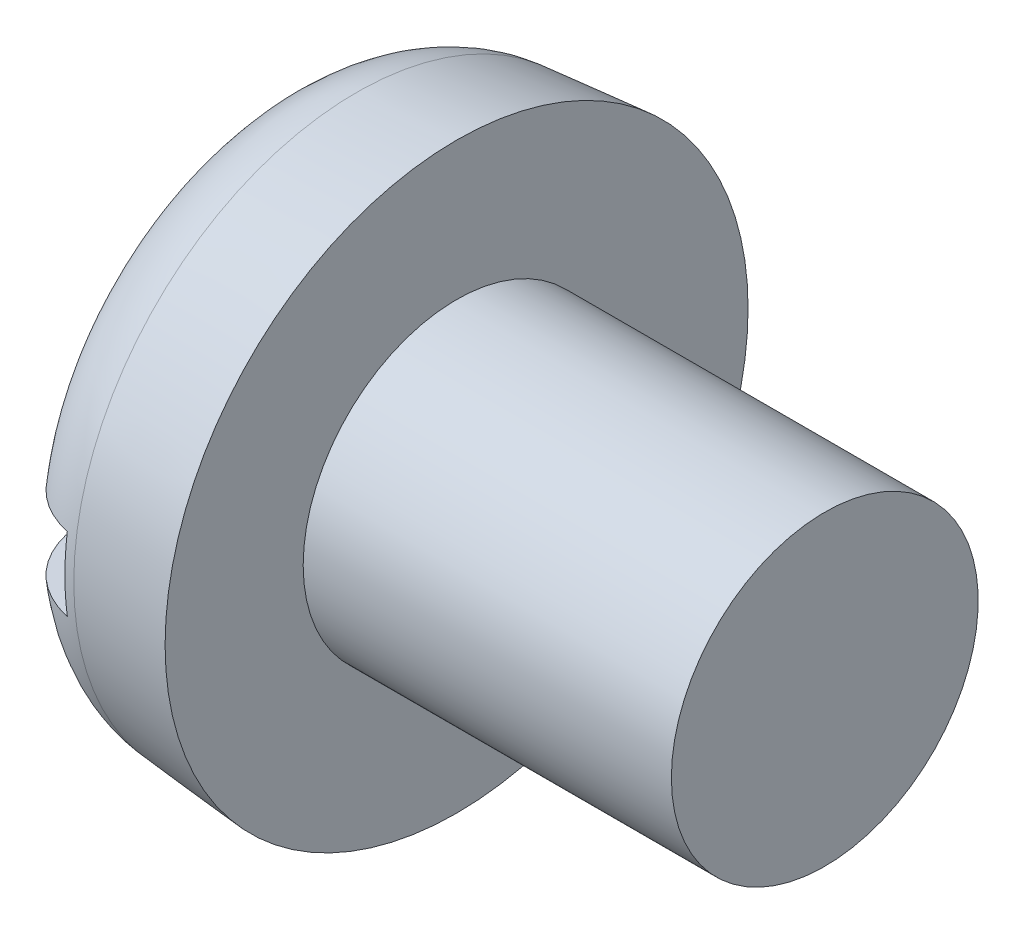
ISO-10303-21;
HEADER;
FILE_DESCRIPTION(('STEP AP214'),'2;1');
FILE_NAME('part.step','',(''),(''),'','','');
FILE_SCHEMA(('AUTOMOTIVE_DESIGN { 1 0 10303 214 1 1 1 1 }'));
ENDSEC;
DATA;
#1=APPLICATION_CONTEXT('core data for automotive mechanical design processes');
#2=APPLICATION_PROTOCOL_DEFINITION('international standard','automotive_design',2000,#1);
#3=PRODUCT_CONTEXT('',#1,'mechanical');
#4=PRODUCT('Part','Part','',(#3));
#5=PRODUCT_RELATED_PRODUCT_CATEGORY('part','',(#4));
#6=PRODUCT_DEFINITION_FORMATION('','',#4);
#7=PRODUCT_DEFINITION_CONTEXT('part definition',#1,'design');
#8=PRODUCT_DEFINITION('design','',#6,#7);
#9=PRODUCT_DEFINITION_SHAPE('','',#8);
#10=(LENGTH_UNIT() NAMED_UNIT(*) SI_UNIT(.MILLI.,.METRE.));
#11=(NAMED_UNIT(*) PLANE_ANGLE_UNIT() SI_UNIT($,.RADIAN.));
#12=(NAMED_UNIT(*) SI_UNIT($,.STERADIAN.) SOLID_ANGLE_UNIT());
#13=UNCERTAINTY_MEASURE_WITH_UNIT(LENGTH_MEASURE(1.E-05),#10,'distance_accuracy_value','');
#14=(GEOMETRIC_REPRESENTATION_CONTEXT(3) GLOBAL_UNCERTAINTY_ASSIGNED_CONTEXT((#13)) GLOBAL_UNIT_ASSIGNED_CONTEXT((#10,
#11,#12)) REPRESENTATION_CONTEXT('',''));
#15=CARTESIAN_POINT('',(0.,0.,0.));
#16=DIRECTION('',(0.,0.,1.));
#17=DIRECTION('',(1.,0.,0.));
#18=AXIS2_PLACEMENT_3D('',#15,#16,#17);
#19=CARTESIAN_POINT('',(0.,0.,0.));
#20=DIRECTION('',(-1.,0.,0.));
#21=DIRECTION('',(0.,0.,1.));
#22=AXIS2_PLACEMENT_3D('',#19,#20,#21);
#23=PLANE('',#22);
#24=DIRECTION('',(0.,0.,-1.));
#25=VECTOR('',#24,1.);
#26=CARTESIAN_POINT('',(0.,0.599999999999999,4.75));
#27=LINE('',#26,#25);
#28=CARTESIAN_POINT('',(0.,0.599999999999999,3.05466870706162));
#29=VERTEX_POINT('',#28);
#30=CARTESIAN_POINT('',(0.,0.599999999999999,-3.05466870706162));
#31=VERTEX_POINT('',#30);
#32=EDGE_CURVE('E85',#29,#31,#27,.T.);
#33=ORIENTED_EDGE('',*,*,#32,.F.);
#34=CARTESIAN_POINT('',(0.,0.,0.));
#35=DIRECTION('',(-1.,0.,0.));
#36=DIRECTION('',(0.,0.,1.));
#37=AXIS2_PLACEMENT_3D('',#34,#35,#36);
#38=CIRCLE('',#37,3.11303724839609);
#39=EDGE_CURVE('E91',#29,#31,#38,.T.);
#40=ORIENTED_EDGE('',*,*,#39,.T.);
#41=EDGE_LOOP('',(#33,#40));
#42=FACE_BOUND('',#41,.T.);
#43=ADVANCED_FACE('F32',(#42),#23,.T.);
#44=CARTESIAN_POINT('',(-25.4,0.,0.));
#45=DIRECTION('',(-1.,0.,0.));
#46=DIRECTION('',(0.,0.,1.));
#47=AXIS2_PLACEMENT_3D('',#44,#45,#46);
#48=CYLINDRICAL_SURFACE('',#47,2.5);
#49=CARTESIAN_POINT('',(9.,0.,0.));
#50=DIRECTION('',(-1.,0.,0.));
#51=DIRECTION('',(0.,0.,1.));
#52=AXIS2_PLACEMENT_3D('',#49,#50,#51);
#53=CIRCLE('',#52,2.5);
#54=CARTESIAN_POINT('',(9.,0.,2.5));
#55=VERTEX_POINT('',#54);
#56=EDGE_CURVE('E92',#55,#55,#53,.T.);
#57=ORIENTED_EDGE('',*,*,#56,.T.);
#58=EDGE_LOOP('',(#57));
#59=FACE_BOUND('',#58,.T.);
#60=CARTESIAN_POINT('',(3.,0.,0.));
#61=DIRECTION('',(-1.,0.,0.));
#62=DIRECTION('',(0.,0.,1.));
#63=AXIS2_PLACEMENT_3D('',#60,#61,#62);
#64=CIRCLE('',#63,2.5);
#65=CARTESIAN_POINT('',(3.,0.,2.5));
#66=VERTEX_POINT('',#65);
#67=EDGE_CURVE('E149',#66,#66,#64,.T.);
#68=ORIENTED_EDGE('',*,*,#67,.F.);
#69=EDGE_LOOP('',(#68));
#70=FACE_BOUND('',#69,.T.);
#71=ADVANCED_FACE('F137',(#59,#70),#48,.T.);
#72=CARTESIAN_POINT('',(9.,2.5,0.));
#73=DIRECTION('',(1.,0.,0.));
#74=DIRECTION('',(0.,0.,-1.));
#75=AXIS2_PLACEMENT_3D('',#72,#73,#74);
#76=PLANE('',#75);
#77=ORIENTED_EDGE('',*,*,#56,.F.);
#78=EDGE_LOOP('',(#77));
#79=FACE_BOUND('',#78,.T.);
#80=ADVANCED_FACE('F135',(#79),#76,.T.);
#81=DIRECTION('',(0.,0.,1.));
#82=VECTOR('',#81,1.);
#83=CARTESIAN_POINT('',(0.,-0.599999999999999,-4.75));
#84=LINE('',#83,#82);
#85=CARTESIAN_POINT('',(0.,-0.599999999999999,-3.05466870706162));
#86=VERTEX_POINT('',#85);
#87=CARTESIAN_POINT('',(0.,-0.6,3.05466870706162));
#88=VERTEX_POINT('',#87);
#89=EDGE_CURVE('E76',#86,#88,#84,.T.);
#90=ORIENTED_EDGE('',*,*,#89,.F.);
#91=EDGE_CURVE('E83',#86,#88,#38,.T.);
#92=ORIENTED_EDGE('',*,*,#91,.T.);
#93=EDGE_LOOP('',(#90,#92));
#94=FACE_BOUND('',#93,.T.);
#95=ADVANCED_FACE('F82',(#94),#23,.T.);
#96=CARTESIAN_POINT('',(0.,0.,0.));
#97=DIRECTION('',(1.,0.,0.));
#98=DIRECTION('',(0.,0.,-1.));
#99=AXIS2_PLACEMENT_3D('',#96,#97,#98);
#100=CONICAL_SURFACE('',#99,4.48753400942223,0.0872664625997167);
#101=CARTESIAN_POINT('',(1.36926638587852,0.,0.));
#102=DIRECTION('',(-1.,0.,0.));
#103=DIRECTION('',(0.,0.,1.));
#104=AXIS2_PLACEMENT_3D('',#101,#102,#103);
#105=CIRCLE('',#104,4.60732929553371);
#106=CARTESIAN_POINT('',(1.36926638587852,0.,4.60732929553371));
#107=VERTEX_POINT('',#106);
#108=EDGE_CURVE('E95',#107,#107,#105,.F.);
#109=ORIENTED_EDGE('',*,*,#108,.T.);
#110=EDGE_LOOP('',(#109));
#111=FACE_BOUND('',#110,.T.);
#112=CARTESIAN_POINT('',(3.,0.,0.));
#113=DIRECTION('',(-1.,0.,0.));
#114=DIRECTION('',(0.,0.,1.));
#115=AXIS2_PLACEMENT_3D('',#112,#113,#114);
#116=CIRCLE('',#115,4.75);
#117=CARTESIAN_POINT('',(3.,0.,4.75));
#118=VERTEX_POINT('',#117);
#119=EDGE_CURVE('E97',#118,#118,#116,.T.);
#120=ORIENTED_EDGE('',*,*,#119,.T.);
#121=EDGE_LOOP('',(#120));
#122=FACE_BOUND('',#121,.T.);
#123=ADVANCED_FACE('F128',(#111,#122),#100,.T.);
#124=CARTESIAN_POINT('',(3.,2.5,0.));
#125=DIRECTION('',(-1.,0.,0.));
#126=DIRECTION('',(0.,0.,1.));
#127=AXIS2_PLACEMENT_3D('',#124,#125,#126);
#128=PLANE('',#127);
#129=ORIENTED_EDGE('',*,*,#119,.F.);
#130=EDGE_LOOP('',(#129));
#131=FACE_BOUND('',#130,.T.);
#132=ORIENTED_EDGE('',*,*,#67,.T.);
#133=EDGE_LOOP('',(#132));
#134=FACE_BOUND('',#133,.T.);
#135=ADVANCED_FACE('F124',(#131,#134),#128,.F.);
#136=CARTESIAN_POINT('',(1.5,0.,0.));
#137=DIRECTION('',(-1.,0.,0.));
#138=DIRECTION('',(0.,0.,1.));
#139=AXIS2_PLACEMENT_3D('',#136,#137,#138);
#140=TOROIDAL_SURFACE('',#139,3.11303724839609,1.5);
#141=CARTESIAN_POINT('',(0.474243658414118,0.599999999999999,-4.16448807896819));
#142=CARTESIAN_POINT('',(0.535197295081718,0.599999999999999,-4.2222007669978));
#143=CARTESIAN_POINT('',(0.601040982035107,0.599999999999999,-4.27483380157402));
#144=CARTESIAN_POINT('',(0.740675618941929,0.599999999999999,-4.36835495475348));
#145=CARTESIAN_POINT('',(0.814475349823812,0.599999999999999,-4.40922990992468));
#146=CARTESIAN_POINT('',(0.967890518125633,0.599999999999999,-4.47797693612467));
#147=CARTESIAN_POINT('',(1.04750461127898,0.599999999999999,-4.50585200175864));
#148=CARTESIAN_POINT('',(1.21027286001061,0.599999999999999,-4.54777716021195));
#149=CARTESIAN_POINT('',(1.29342617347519,0.599999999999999,-4.56183052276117));
#150=CARTESIAN_POINT('',(1.46061786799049,0.599999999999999,-4.57568541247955));
#151=CARTESIAN_POINT('',(1.54465212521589,0.599999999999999,-4.57553672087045));
#152=CARTESIAN_POINT('',(1.71150157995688,0.599999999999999,-4.56111544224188));
#153=CARTESIAN_POINT('',(1.79431675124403,0.599999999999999,-4.546842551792));
#154=CARTESIAN_POINT('',(1.95628107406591,0.599999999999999,-4.50461633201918));
#155=CARTESIAN_POINT('',(2.03543426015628,0.599999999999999,-4.47667847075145));
#156=CARTESIAN_POINT('',(2.18794473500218,0.599999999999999,-4.40794662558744));
#157=CARTESIAN_POINT('',(2.26130200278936,0.599999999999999,-4.36715259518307));
#158=CARTESIAN_POINT('',(2.40037319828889,0.599999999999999,-4.27376142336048));
#159=CARTESIAN_POINT('',(2.46606492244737,0.599999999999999,-4.22113122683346));
#160=CARTESIAN_POINT('',(2.58775416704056,0.599999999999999,-4.10565865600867));
#161=CARTESIAN_POINT('',(2.64375146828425,0.599999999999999,-4.04281605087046));
#162=CARTESIAN_POINT('',(2.7448997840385,0.599999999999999,-3.90824759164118));
#163=CARTESIAN_POINT('',(2.78997229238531,0.599999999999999,-3.83646274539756));
#164=CARTESIAN_POINT('',(2.86758143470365,0.599999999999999,-3.6864129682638));
#165=CARTESIAN_POINT('',(2.90011748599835,0.599999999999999,-3.60814773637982));
#166=CARTESIAN_POINT('',(2.95215516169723,0.599999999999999,-3.44640006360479));
#167=CARTESIAN_POINT('',(2.9715017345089,0.599999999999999,-3.36286776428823));
#168=CARTESIAN_POINT('',(2.99613620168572,0.599999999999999,-3.19375865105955));
#169=CARTESIAN_POINT('',(3.00142305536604,0.599999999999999,-3.10818168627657));
#170=CARTESIAN_POINT('',(2.9978948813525,0.599999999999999,-2.93593785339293));
#171=CARTESIAN_POINT('',(2.98885075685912,0.599999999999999,-2.84927570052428));
#172=CARTESIAN_POINT('',(2.95661294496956,0.599999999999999,-2.67862588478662));
#173=CARTESIAN_POINT('',(2.93341783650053,0.599999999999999,-2.59463849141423));
#174=CARTESIAN_POINT('',(2.87305940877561,0.599999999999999,-2.43009011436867));
#175=CARTESIAN_POINT('',(2.8356478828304,0.599999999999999,-2.3496201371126));
#176=CARTESIAN_POINT('',(2.74798933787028,0.599999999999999,-2.1959917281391));
#177=CARTESIAN_POINT('',(2.69774036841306,0.599999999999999,-2.12283440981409));
#178=CARTESIAN_POINT('',(2.58515210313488,0.599999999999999,-1.98517825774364));
#179=CARTESIAN_POINT('',(2.52268993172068,0.599999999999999,-1.92077976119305));
#180=CARTESIAN_POINT('',(2.3876474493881,0.599999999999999,-1.80360821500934));
#181=CARTESIAN_POINT('',(2.31506700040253,0.599999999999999,-1.75083532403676));
#182=CARTESIAN_POINT('',(2.16324197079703,0.599999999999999,-1.65981326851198));
#183=CARTESIAN_POINT('',(2.08415844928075,0.599999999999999,-1.62129637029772));
#184=CARTESIAN_POINT('',(1.92036681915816,0.599999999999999,-1.55909823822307));
#185=CARTESIAN_POINT('',(1.83566227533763,0.599999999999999,-1.53540769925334));
#186=CARTESIAN_POINT('',(1.66868507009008,0.599999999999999,-1.50512561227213));
#187=CARTESIAN_POINT('',(1.58658829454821,0.599999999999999,-1.4975631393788));
#188=CARTESIAN_POINT('',(1.42235866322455,0.599999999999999,-1.49703912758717));
#189=CARTESIAN_POINT('',(1.34022582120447,0.599999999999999,-1.50407401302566));
#190=CARTESIAN_POINT('',(1.18200056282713,0.599999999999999,-1.53172166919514));
#191=CARTESIAN_POINT('',(1.10580089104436,0.599999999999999,-1.55172937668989));
#192=CARTESIAN_POINT('',(0.957649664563,0.599999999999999,-1.60381093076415));
#193=CARTESIAN_POINT('',(0.885698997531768,0.599999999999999,-1.63588728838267));
#194=CARTESIAN_POINT('',(0.745245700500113,0.599999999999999,-1.71223681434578));
#195=CARTESIAN_POINT('',(0.676958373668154,0.599999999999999,-1.75690511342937));
#196=CARTESIAN_POINT('',(0.548253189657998,0.599999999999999,-1.85641398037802));
#197=CARTESIAN_POINT('',(0.487837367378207,0.599999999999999,-1.91125716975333));
#198=CARTESIAN_POINT('',(0.372604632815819,0.599999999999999,-2.0333995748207));
#199=CARTESIAN_POINT('',(0.318393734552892,0.599999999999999,-2.10127142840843));
#200=CARTESIAN_POINT('',(0.22172170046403,0.599999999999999,-2.24492747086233));
#201=CARTESIAN_POINT('',(0.179262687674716,0.599999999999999,-2.32071308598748));
#202=CARTESIAN_POINT('',(0.106126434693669,0.599999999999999,-2.48060945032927));
#203=CARTESIAN_POINT('',(0.0758504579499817,0.599999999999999,-2.56490423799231));
#204=CARTESIAN_POINT('',(0.0299480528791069,0.599999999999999,-2.737393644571));
#205=CARTESIAN_POINT('',(0.0143211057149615,0.599999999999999,-2.82558812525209));
#206=CARTESIAN_POINT('',(-0.00166405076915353,0.599999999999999,-3.00295249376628));
#207=CARTESIAN_POINT('',(-0.0020913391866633,0.599999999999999,-3.09211612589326));
#208=CARTESIAN_POINT('',(0.012315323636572,0.599999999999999,-3.26923006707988));
#209=CARTESIAN_POINT('',(0.0271518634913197,0.599999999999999,-3.35718016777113));
#210=CARTESIAN_POINT('',(0.0713942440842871,0.599999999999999,-3.52770551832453));
#211=CARTESIAN_POINT('',(0.100543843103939,0.599999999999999,-3.61034739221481));
#212=CARTESIAN_POINT('',(0.172532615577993,0.599999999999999,-3.7693538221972));
#213=CARTESIAN_POINT('',(0.215353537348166,0.599999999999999,-3.84572657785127));
#214=CARTESIAN_POINT('',(0.294810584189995,0.599999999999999,-3.9625299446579));
#215=CARTESIAN_POINT('',(0.327631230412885,0.599999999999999,-4.00560511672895));
#216=CARTESIAN_POINT('',(0.397705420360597,0.599999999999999,-4.08798619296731));
#217=CARTESIAN_POINT('',(0.434958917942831,0.599999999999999,-4.12729213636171));
#218=CARTESIAN_POINT('',(0.474243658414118,0.599999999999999,-4.16448807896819));
#219=B_SPLINE_CURVE_WITH_KNOTS('',3,(#141,#142,#143,#144,#145,#146,#147,#148,#149,#150,#151,
#152,#153,#154,#155,#156,#157,#158,#159,#160,#161,#162,#163,#164,#165,#166,#167,#168,#169,#170,
#171,#172,#173,#174,#175,#176,#177,#178,#179,#180,#181,#182,#183,#184,#185,#186,#187,#188,#189,
#190,#191,#192,#193,#194,#195,#196,#197,#198,#199,#200,#201,#202,#203,#204,#205,#206,#207,#208,
#209,#210,#211,#212,#213,#214,#215,#216,#217,#218),.UNSPECIFIED.,.T.,.F.,(4,2,2,2,2,2,2,2,2,2,2,
2,2,2,2,2,2,2,2,2,2,2,2,2,2,2,2,2,2,2,2,2,2,2,2,2,2,2,4),(0.,0.251627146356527,
0.503534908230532,0.755384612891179,1.00717472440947,1.25808229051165,1.50899524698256,
1.75962483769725,2.01025533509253,2.26159466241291,2.5129396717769,2.76604060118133,
3.01915329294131,3.27519243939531,3.53125053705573,3.79144347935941,4.05166255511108,
4.31665070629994,4.58167914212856,4.84952563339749,5.1173757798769,5.37990411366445,
5.64226751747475,5.88833003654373,6.13433228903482,6.36961414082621,6.60494497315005,
6.84869102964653,7.09249997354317,7.35191672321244,7.61138030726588,7.87880123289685,
8.14621268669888,8.41240865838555,8.67864978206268,8.94028930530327,9.20158098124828,
9.36375686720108,9.52593106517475),.UNSPECIFIED.);
#220=CARTESIAN_POINT('',(1.2,0.599999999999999,-4.54328342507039));
#221=VERTEX_POINT('',#220);
#222=EDGE_CURVE('E11',#31,#221,#219,.T.);
#223=ORIENTED_EDGE('',*,*,#222,.F.);
#224=ORIENTED_EDGE('',*,*,#39,.F.);
#225=CARTESIAN_POINT('',(0.642058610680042,0.599999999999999,1.78444467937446));
#226=CARTESIAN_POINT('',(0.708203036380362,0.599999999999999,1.73578880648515));
#227=CARTESIAN_POINT('',(0.778279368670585,0.599999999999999,1.69241067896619));
#228=CARTESIAN_POINT('',(0.924661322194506,0.599999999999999,1.61775076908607));
#229=CARTESIAN_POINT('',(1.00097010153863,0.599999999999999,1.58647516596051));
#230=CARTESIAN_POINT('',(1.15801751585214,0.599999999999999,1.537335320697));
#231=CARTESIAN_POINT('',(1.23876602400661,0.599999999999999,1.51950238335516));
#232=CARTESIAN_POINT('',(1.40212199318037,0.599999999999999,1.49831173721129));
#233=CARTESIAN_POINT('',(1.48472861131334,0.599999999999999,1.49494759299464));
#234=CARTESIAN_POINT('',(1.64595983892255,0.599999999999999,1.50270631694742));
#235=CARTESIAN_POINT('',(1.72461257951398,0.599999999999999,1.51326068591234));
#236=CARTESIAN_POINT('',(1.8790539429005,0.599999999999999,1.54733501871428));
#237=CARTESIAN_POINT('',(1.95484205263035,0.599999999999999,1.57085729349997));
#238=CARTESIAN_POINT('',(2.10217401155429,0.599999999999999,1.63005609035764));
#239=CARTESIAN_POINT('',(2.17368023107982,0.599999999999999,1.6658257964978));
#240=CARTESIAN_POINT('',(2.310172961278,0.599999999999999,1.74815983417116));
#241=CARTESIAN_POINT('',(2.37515789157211,0.599999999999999,1.79472677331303));
#242=CARTESIAN_POINT('',(2.50111037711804,0.599999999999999,1.90052230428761));
#243=CARTESIAN_POINT('',(2.56156048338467,0.599999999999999,1.96036731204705));
#244=CARTESIAN_POINT('',(2.67210720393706,0.599999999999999,2.08896077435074));
#245=CARTESIAN_POINT('',(2.72220143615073,0.599999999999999,2.15771127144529));
#246=CARTESIAN_POINT('',(2.81284735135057,0.599999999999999,2.30563751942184));
#247=CARTESIAN_POINT('',(2.85285618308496,0.599999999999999,2.38514674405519));
#248=CARTESIAN_POINT('',(2.91905433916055,0.599999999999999,2.54972911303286));
#249=CARTESIAN_POINT('',(2.94524280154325,0.599999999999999,2.63480260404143));
#250=CARTESIAN_POINT('',(2.98307112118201,0.599999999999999,2.80866920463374));
#251=CARTESIAN_POINT('',(2.9946229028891,0.599999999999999,2.89748154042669));
#252=CARTESIAN_POINT('',(3.00240662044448,0.599999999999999,3.07577878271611));
#253=CARTESIAN_POINT('',(2.998639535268,0.599999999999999,3.16526364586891));
#254=CARTESIAN_POINT('',(2.97592433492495,0.599999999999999,3.34090743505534));
#255=CARTESIAN_POINT('',(2.95720740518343,0.599999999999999,3.42709622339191));
#256=CARTESIAN_POINT('',(2.90529569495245,0.599999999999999,3.59499998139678));
#257=CARTESIAN_POINT('',(2.87210231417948,0.599999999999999,3.67671538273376));
#258=CARTESIAN_POINT('',(2.7928517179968,0.599999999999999,3.83175947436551));
#259=CARTESIAN_POINT('',(2.7470416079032,0.599999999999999,3.90521449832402));
#260=CARTESIAN_POINT('',(2.64356788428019,0.599999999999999,4.04323981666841));
#261=CARTESIAN_POINT('',(2.58590525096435,0.599999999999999,4.10781084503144));
#262=CARTESIAN_POINT('',(2.46128327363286,0.599999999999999,4.22525214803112));
#263=CARTESIAN_POINT('',(2.39447165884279,0.599999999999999,4.27827922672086));
#264=CARTESIAN_POINT('',(2.25282231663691,0.599999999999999,4.37223374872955));
#265=CARTESIAN_POINT('',(2.17798504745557,0.599999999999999,4.41316188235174));
#266=CARTESIAN_POINT('',(2.02319107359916,0.599999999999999,4.48136089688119));
#267=CARTESIAN_POINT('',(1.94329070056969,0.599999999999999,4.50875968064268));
#268=CARTESIAN_POINT('',(1.78001182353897,0.599999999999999,4.54967680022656));
#269=CARTESIAN_POINT('',(1.69663343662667,0.599999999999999,4.5631956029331));
#270=CARTESIAN_POINT('',(1.52922201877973,0.599999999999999,4.57591948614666));
#271=CARTESIAN_POINT('',(1.44519451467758,0.599999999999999,4.57519739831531));
#272=CARTESIAN_POINT('',(1.27845728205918,0.599999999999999,4.55963992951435));
#273=CARTESIAN_POINT('',(1.19574753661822,0.599999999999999,4.54480472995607));
#274=CARTESIAN_POINT('',(1.0340786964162,0.599999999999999,4.50147996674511));
#275=CARTESIAN_POINT('',(0.95511580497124,0.599999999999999,4.47300456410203));
#276=CARTESIAN_POINT('',(0.803072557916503,0.599999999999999,4.40323812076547));
#277=CARTESIAN_POINT('',(0.729992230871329,0.599999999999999,4.36194701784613));
#278=CARTESIAN_POINT('',(0.59154832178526,0.599999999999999,4.26761123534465));
#279=CARTESIAN_POINT('',(0.526207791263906,0.599999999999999,4.21453273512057));
#280=CARTESIAN_POINT('',(0.405289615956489,0.599999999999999,4.09822911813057));
#281=CARTESIAN_POINT('',(0.349712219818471,0.599999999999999,4.03500374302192));
#282=CARTESIAN_POINT('',(0.249458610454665,0.599999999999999,3.89973755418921));
#283=CARTESIAN_POINT('',(0.204862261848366,0.599999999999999,3.82763756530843));
#284=CARTESIAN_POINT('',(0.128249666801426,0.599999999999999,3.67704118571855));
#285=CARTESIAN_POINT('',(0.0962340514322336,0.599999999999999,3.59854447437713));
#286=CARTESIAN_POINT('',(0.0452695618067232,0.599999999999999,3.43641182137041));
#287=CARTESIAN_POINT('',(0.0264776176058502,0.599999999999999,3.35272657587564));
#288=CARTESIAN_POINT('',(0.00296961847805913,0.599999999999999,3.18340853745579));
#289=CARTESIAN_POINT('',(-0.00174593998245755,0.599999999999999,3.09777567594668));
#290=CARTESIAN_POINT('',(0.00293340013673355,0.599999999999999,2.92551527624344));
#291=CARTESIAN_POINT('',(0.0125572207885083,0.599999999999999,2.83889398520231));
#292=CARTESIAN_POINT('',(0.045943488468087,0.599999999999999,2.66839997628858));
#293=CARTESIAN_POINT('',(0.0697105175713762,0.599999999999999,2.58452815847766));
#294=CARTESIAN_POINT('',(0.131206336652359,0.599999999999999,2.42028022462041));
#295=CARTESIAN_POINT('',(0.169188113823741,0.599999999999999,2.3399989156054));
#296=CARTESIAN_POINT('',(0.257932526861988,0.599999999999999,2.18690708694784));
#297=CARTESIAN_POINT('',(0.308683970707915,0.599999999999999,2.11409010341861));
#298=CARTESIAN_POINT('',(0.405756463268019,0.599999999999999,1.9970345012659));
#299=CARTESIAN_POINT('',(0.449343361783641,0.599999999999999,1.9505006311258));
#300=CARTESIAN_POINT('',(0.54185180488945,0.599999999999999,1.86306846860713));
#301=CARTESIAN_POINT('',(0.590773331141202,0.599999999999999,1.82217015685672));
#302=CARTESIAN_POINT('',(0.642058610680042,0.599999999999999,1.78444467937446));
#303=B_SPLINE_CURVE_WITH_KNOTS('',3,(#225,#226,#227,#228,#229,#230,#231,#232,#233,#234,#235,
#236,#237,#238,#239,#240,#241,#242,#243,#244,#245,#246,#247,#248,#249,#250,#251,#252,#253,#254,
#255,#256,#257,#258,#259,#260,#261,#262,#263,#264,#265,#266,#267,#268,#269,#270,#271,#272,#273,
#274,#275,#276,#277,#278,#279,#280,#281,#282,#283,#284,#285,#286,#287,#288,#289,#290,#291,#292,
#293,#294,#295,#296,#297,#298,#299,#300,#301,#302),.UNSPECIFIED.,.T.,.F.,(4,2,2,2,2,2,2,2,2,2,2,
2,2,2,2,2,2,2,2,2,2,2,2,2,2,2,2,2,2,2,2,2,2,2,2,2,2,2,4),(0.,0.24612605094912,0.492377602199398,
0.739200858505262,0.985914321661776,1.22285638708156,1.45984069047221,1.69866969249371,
1.93755643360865,2.19161852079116,2.4457389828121,2.7115111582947,2.97729990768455,
3.24468054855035,3.51204410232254,3.77535136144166,4.03863316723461,4.29708605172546,
4.55551757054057,4.81018291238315,5.06483372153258,5.31702870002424,5.56921519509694,
5.82011227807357,6.07100613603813,6.32164008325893,6.57227524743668,6.8236390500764,
7.07500925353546,7.32815697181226,7.58131738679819,7.83743366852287,8.09355898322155,
8.35381727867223,8.61415993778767,8.87937525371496,9.14435892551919,9.33519415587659,
9.52602873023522),.UNSPECIFIED.);
#304=CARTESIAN_POINT('',(1.2,0.599999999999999,4.54328342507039));
#305=VERTEX_POINT('',#304);
#306=EDGE_CURVE('E109',#305,#29,#303,.T.);
#307=ORIENTED_EDGE('',*,*,#306,.F.);
#308=CARTESIAN_POINT('',(1.2,0.,0.));
#309=DIRECTION('',(-1.,0.,0.));
#310=DIRECTION('',(0.,0.,1.));
#311=AXIS2_PLACEMENT_3D('',#308,#309,#310);
#312=CIRCLE('',#311,4.582731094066);
#313=CARTESIAN_POINT('',(1.2,-0.6,4.54328342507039));
#314=VERTEX_POINT('',#313);
#315=EDGE_CURVE('E103',#305,#314,#312,.F.);
#316=ORIENTED_EDGE('',*,*,#315,.T.);
#317=CARTESIAN_POINT('',(0.642058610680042,-0.6,1.78444467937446));
#318=CARTESIAN_POINT('',(0.570752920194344,-0.6,1.83690352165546));
#319=CARTESIAN_POINT('',(0.503916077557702,-0.6,1.89557553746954));
#320=CARTESIAN_POINT('',(0.380973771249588,-0.6,2.02337981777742));
#321=CARTESIAN_POINT('',(0.324888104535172,-0.6,2.09253096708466));
#322=CARTESIAN_POINT('',(0.225075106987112,-0.6,2.23912059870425));
#323=CARTESIAN_POINT('',(0.181331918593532,-0.6,2.31654826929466));
#324=CARTESIAN_POINT('',(0.10735821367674,-0.6,2.4775679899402));
#325=CARTESIAN_POINT('',(0.0771217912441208,-0.6,2.56115732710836));
#326=CARTESIAN_POINT('',(0.0308710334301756,-0.6,2.732939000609));
#327=CARTESIAN_POINT('',(0.0149771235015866,-0.6,2.82116384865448));
#328=CARTESIAN_POINT('',(-0.0015567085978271,-0.6,2.99904386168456));
#329=CARTESIAN_POINT('',(-0.00219606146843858,-0.6,3.08869907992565));
#330=CARTESIAN_POINT('',(0.0118531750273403,-0.6,3.26558059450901));
#331=CARTESIAN_POINT('',(0.0263341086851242,-0.6,3.35282334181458));
#332=CARTESIAN_POINT('',(0.0700194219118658,-0.6,3.52354291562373));
#333=CARTESIAN_POINT('',(0.099222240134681,-0.6,3.60702014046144));
#334=CARTESIAN_POINT('',(0.170926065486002,-0.6,3.76619303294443));
#335=CARTESIAN_POINT('',(0.213170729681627,-0.6,3.84200419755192));
#336=CARTESIAN_POINT('',(0.309975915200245,-0.6,3.98530836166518));
#337=CARTESIAN_POINT('',(0.364535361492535,-0.6,4.05280208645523));
#338=CARTESIAN_POINT('',(0.483508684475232,-0.6,4.1764763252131));
#339=CARTESIAN_POINT('',(0.5477595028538,-0.6,4.23281374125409));
#340=CARTESIAN_POINT('',(0.684891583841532,-0.6,4.33376627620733));
#341=CARTESIAN_POINT('',(0.757772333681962,-0.6,4.37838209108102));
#342=CARTESIAN_POINT('',(0.909277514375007,-0.6,4.45415785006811));
#343=CARTESIAN_POINT('',(0.98783477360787,-0.6,4.4854521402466));
#344=CARTESIAN_POINT('',(1.14910626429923,-0.6,4.53432193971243));
#345=CARTESIAN_POINT('',(1.23182034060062,-0.6,4.55189796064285));
#346=CARTESIAN_POINT('',(1.39854874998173,-0.6,4.57274942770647));
#347=CARTESIAN_POINT('',(1.48255291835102,-0.6,4.57610622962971));
#348=CARTESIAN_POINT('',(1.64992840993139,-0.6,4.56864397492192));
#349=CARTESIAN_POINT('',(1.73329974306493,-0.6,4.55782514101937));
#350=CARTESIAN_POINT('',(1.89690556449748,-0.6,4.5223590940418));
#351=CARTESIAN_POINT('',(1.97714487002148,-0.6,4.49773409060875));
#352=CARTESIAN_POINT('',(2.13236381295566,-0.6,4.43539277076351));
#353=CARTESIAN_POINT('',(2.20734343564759,-0.6,4.39767641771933));
#354=CARTESIAN_POINT('',(2.35011399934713,-0.6,4.31014761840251));
#355=CARTESIAN_POINT('',(2.41788774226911,-0.6,4.26030712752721));
#356=CARTESIAN_POINT('',(2.54417141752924,-0.6,4.15002218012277));
#357=CARTESIAN_POINT('',(2.60268114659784,-0.6,4.08957749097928));
#358=CARTESIAN_POINT('',(2.70919785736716,-0.6,3.9593981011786));
#359=CARTESIAN_POINT('',(2.75713464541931,-0.6,3.88960598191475));
#360=CARTESIAN_POINT('',(2.84075534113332,-0.6,3.74303514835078));
#361=CARTESIAN_POINT('',(2.8764387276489,-0.6,3.66625613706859));
#362=CARTESIAN_POINT('',(2.93498131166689,-0.6,3.50699921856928));
#363=CARTESIAN_POINT('',(2.95769541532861,-0.6,3.42446799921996));
#364=CARTESIAN_POINT('',(2.98917609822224,-0.6,3.25679047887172));
#365=CARTESIAN_POINT('',(2.99794169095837,-0.6,3.17164399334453));
#366=CARTESIAN_POINT('',(3.00144063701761,-0.6,2.99973325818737));
#367=CARTESIAN_POINT('',(2.99595250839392,-0.6,2.91296452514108));
#368=CARTESIAN_POINT('',(2.97076041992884,-0.6,2.74151789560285));
#369=CARTESIAN_POINT('',(2.95105508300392,-0.6,2.6568402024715));
#370=CARTESIAN_POINT('',(2.8975856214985,-0.6,2.49032583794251));
#371=CARTESIAN_POINT('',(2.86356984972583,-0.6,2.40856994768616));
#372=CARTESIAN_POINT('',(2.78246737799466,-0.6,2.25181146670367));
#373=CARTESIAN_POINT('',(2.73537879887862,-0.6,2.17680984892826));
#374=CARTESIAN_POINT('',(2.6287380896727,-0.6,2.03476656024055));
#375=CARTESIAN_POINT('',(2.56903700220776,-0.6,1.96783656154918));
#376=CARTESIAN_POINT('',(2.43909597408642,-0.6,1.84509773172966));
#377=CARTESIAN_POINT('',(2.36885525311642,-0.6,1.7892897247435));
#378=CARTESIAN_POINT('',(2.22077231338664,-0.6,1.6915159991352));
#379=CARTESIAN_POINT('',(2.14305625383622,-0.6,1.64935982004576));
#380=CARTESIAN_POINT('',(1.98134627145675,-0.6,1.57962775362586));
#381=CARTESIAN_POINT('',(1.89735630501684,-0.6,1.55204276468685));
#382=CARTESIAN_POINT('',(1.73074700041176,-0.6,1.51405337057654));
#383=CARTESIAN_POINT('',(1.64833577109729,-0.6,1.50273689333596));
#384=CARTESIAN_POINT('',(1.48280159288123,-0.6,1.49493998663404));
#385=CARTESIAN_POINT('',(1.39967868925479,-0.6,1.49845862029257));
#386=CARTESIAN_POINT('',(1.23954957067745,-0.6,1.5195684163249));
#387=CARTESIAN_POINT('',(1.16244637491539,-0.6,1.53644040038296));
#388=CARTESIAN_POINT('',(1.01210690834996,-0.6,1.58254863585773));
#389=CARTESIAN_POINT('',(0.938866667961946,-0.6,1.61177190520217));
#390=CARTESIAN_POINT('',(0.828774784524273,-0.6,1.66615585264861));
#391=CARTESIAN_POINT('',(0.789995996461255,-0.6,1.68752043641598));
#392=CARTESIAN_POINT('',(0.714458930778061,-0.6,1.73355428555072));
#393=CARTESIAN_POINT('',(0.677700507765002,-0.6,1.75822331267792));
#394=CARTESIAN_POINT('',(0.642058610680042,-0.6,1.78444467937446));
#395=B_SPLINE_CURVE_WITH_KNOTS('',3,(#317,#318,#319,#320,#321,#322,#323,#324,#325,#326,#327,
#328,#329,#330,#331,#332,#333,#334,#335,#336,#337,#338,#339,#340,#341,#342,#343,#344,#345,#346,
#347,#348,#349,#350,#351,#352,#353,#354,#355,#356,#357,#358,#359,#360,#361,#362,#363,#364,#365,
#366,#367,#368,#369,#370,#371,#372,#373,#374,#375,#376,#377,#378,#379,#380,#381,#382,#383,#384,
#385,#386,#387,#388,#389,#390,#391,#392,#393,#394),.UNSPECIFIED.,.T.,.F.,(4,2,2,2,2,2,2,2,2,2,2,
2,2,2,2,2,2,2,2,2,2,2,2,2,2,2,2,2,2,2,2,2,2,2,2,2,2,2,4),(0.,0.265404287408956,
0.531292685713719,0.796837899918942,1.0622668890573,1.32990433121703,1.59755176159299,
1.86157117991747,2.12556260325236,2.38466409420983,2.64374297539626,2.89886888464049,
3.15397964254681,3.40645291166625,3.65891676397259,3.90993416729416,4.16094762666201,
4.41155844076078,4.66216995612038,4.91336677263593,5.1645691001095,5.41739205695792,
5.67022576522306,5.92583525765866,6.18146282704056,6.44108615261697,6.70073462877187,
6.96515356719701,7.22961053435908,7.49738541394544,7.76518012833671,8.0290593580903,
8.2927735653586,8.54103382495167,8.78927840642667,9.02499451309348,9.2604634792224,
9.39313443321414,9.5257958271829),.UNSPECIFIED.);
#396=EDGE_CURVE('E90',#88,#314,#395,.T.);
#397=ORIENTED_EDGE('',*,*,#396,.F.);
#398=ORIENTED_EDGE('',*,*,#91,.F.);
#399=CARTESIAN_POINT('',(0.474243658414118,-0.599999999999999,-4.16448807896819));
#400=CARTESIAN_POINT('',(0.412409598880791,-0.599999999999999,-4.10593108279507));
#401=CARTESIAN_POINT('',(0.35551684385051,-0.599999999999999,-4.04205754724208));
#402=CARTESIAN_POINT('',(0.253261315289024,-0.599999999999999,-3.90557965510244));
#403=CARTESIAN_POINT('',(0.207914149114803,-0.599999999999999,-3.83296367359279));
#404=CARTESIAN_POINT('',(0.130063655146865,-0.599999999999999,-3.68123851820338));
#405=CARTESIAN_POINT('',(0.0975468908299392,-0.599999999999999,-3.6021362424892));
#406=CARTESIAN_POINT('',(0.0461131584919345,-0.599999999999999,-3.43965944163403));
#407=CARTESIAN_POINT('',(0.027192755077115,-0.599999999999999,-3.35628600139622));
#408=CARTESIAN_POINT('',(0.00320871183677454,-0.599999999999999,-3.18666752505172));
#409=CARTESIAN_POINT('',(-0.00170544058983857,-0.599999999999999,-3.10040138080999));
#410=CARTESIAN_POINT('',(0.00275015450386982,-0.599999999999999,-2.92823768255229));
#411=CARTESIAN_POINT('',(0.012121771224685,-0.599999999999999,-2.84234017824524));
#412=CARTESIAN_POINT('',(0.0450616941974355,-0.599999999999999,-2.67171740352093));
#413=CARTESIAN_POINT('',(0.0688809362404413,-0.6,-2.58704058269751));
#414=CARTESIAN_POINT('',(0.130163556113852,-0.6,-2.42277478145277));
#415=CARTESIAN_POINT('',(0.16762851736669,-0.6,-2.34318639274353));
#416=CARTESIAN_POINT('',(0.255857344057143,-0.6,-2.19000637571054));
#417=CARTESIAN_POINT('',(0.306828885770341,-0.6,-2.11653425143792));
#418=CARTESIAN_POINT('',(0.420399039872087,-0.6,-1.97917572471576));
#419=CARTESIAN_POINT('',(0.482999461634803,-0.6,-1.91529081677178));
#420=CARTESIAN_POINT('',(0.618096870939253,-0.6,-1.79922493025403));
#421=CARTESIAN_POINT('',(0.69057820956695,-0.6,-1.74702578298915));
#422=CARTESIAN_POINT('',(0.843593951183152,-0.6,-1.65617143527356));
#423=CARTESIAN_POINT('',(0.924125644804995,-0.6,-1.61751169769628));
#424=CARTESIAN_POINT('',(1.08726160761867,-0.6,-1.5568894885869));
#425=CARTESIAN_POINT('',(1.16962117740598,-0.6,-1.53427068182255));
#426=CARTESIAN_POINT('',(1.33705452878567,-0.6,-1.50426955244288));
#427=CARTESIAN_POINT('',(1.42212670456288,-0.6,-1.49687837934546));
#428=CARTESIAN_POINT('',(1.58668515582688,-0.6,-1.4977182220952));
#429=CARTESIAN_POINT('',(1.66617813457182,-0.6,-1.50497326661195));
#430=CARTESIAN_POINT('',(1.82279518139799,-0.6,-1.53279061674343));
#431=CARTESIAN_POINT('',(1.89991905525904,-0.6,-1.55335401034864));
#432=CARTESIAN_POINT('',(2.04948924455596,-0.6,-1.6067410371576));
#433=CARTESIAN_POINT('',(2.1219498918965,-0.6,-1.63952477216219));
#434=CARTESIAN_POINT('',(2.26079027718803,-0.6,-1.71610282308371));
#435=CARTESIAN_POINT('',(2.32716854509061,-0.6,-1.75989979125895));
#436=CARTESIAN_POINT('',(2.45624783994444,-0.6,-1.86010993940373));
#437=CARTESIAN_POINT('',(2.51847841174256,-0.6,-1.91712921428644));
#438=CARTESIAN_POINT('',(2.6330655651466,-0.6,-2.04035161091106));
#439=CARTESIAN_POINT('',(2.68541975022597,-0.6,-2.10655695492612));
#440=CARTESIAN_POINT('',(2.78137899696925,-0.6,-2.24995520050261));
#441=CARTESIAN_POINT('',(2.82440841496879,-0.6,-2.32753422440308));
#442=CARTESIAN_POINT('',(2.89698988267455,-0.6,-2.48876491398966));
#443=CARTESIAN_POINT('',(2.92654080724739,-0.599999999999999,-2.57241708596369));
#444=CARTESIAN_POINT('',(2.97147838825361,-0.599999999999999,-2.74436421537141));
#445=CARTESIAN_POINT('',(2.98671795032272,-0.599999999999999,-2.83269773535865));
#446=CARTESIAN_POINT('',(3.0019280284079,-0.599999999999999,-3.01067371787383));
#447=CARTESIAN_POINT('',(3.00189936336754,-0.599999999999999,-3.10031610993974));
#448=CARTESIAN_POINT('',(2.98653324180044,-0.599999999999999,-3.27703669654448));
#449=CARTESIAN_POINT('',(2.97140689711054,-0.599999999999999,-3.36413320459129));
#450=CARTESIAN_POINT('',(2.92646546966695,-0.599999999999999,-3.53445278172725));
#451=CARTESIAN_POINT('',(2.89665181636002,-0.599999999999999,-3.6176762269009));
#452=CARTESIAN_POINT('',(2.82379055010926,-0.599999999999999,-3.77624709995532));
#453=CARTESIAN_POINT('',(2.78099811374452,-0.599999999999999,-3.85171179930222));
#454=CARTESIAN_POINT('',(2.68316564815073,-0.599999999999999,-3.99423591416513));
#455=CARTESIAN_POINT('',(2.62812664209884,-0.599999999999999,-4.06129603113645));
#456=CARTESIAN_POINT('',(2.50827792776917,-0.599999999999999,-4.18404243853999));
#457=CARTESIAN_POINT('',(2.44362896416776,-0.599999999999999,-4.23988572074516));
#458=CARTESIAN_POINT('',(2.3057910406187,-0.599999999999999,-4.33979100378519));
#459=CARTESIAN_POINT('',(2.23260257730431,-0.599999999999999,-4.38385368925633));
#460=CARTESIAN_POINT('',(2.08057460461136,-0.599999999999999,-4.45849174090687));
#461=CARTESIAN_POINT('',(2.00180044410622,-0.599999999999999,-4.4892002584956));
#462=CARTESIAN_POINT('',(1.84020059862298,-0.599999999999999,-4.53687031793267));
#463=CARTESIAN_POINT('',(1.75737522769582,-0.599999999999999,-4.55383292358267));
#464=CARTESIAN_POINT('',(1.59053176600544,-0.599999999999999,-4.5734537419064));
#465=CARTESIAN_POINT('',(1.50652325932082,-0.599999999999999,-4.57619356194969));
#466=CARTESIAN_POINT('',(1.33921886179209,-0.599999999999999,-4.56750581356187));
#467=CARTESIAN_POINT('',(1.25592315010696,-0.599999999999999,-4.55607478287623));
#468=CARTESIAN_POINT('',(1.09252935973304,-0.599999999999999,-4.51940184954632));
#469=CARTESIAN_POINT('',(1.01242810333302,-0.599999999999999,-4.49417405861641));
#470=CARTESIAN_POINT('',(0.857658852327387,-0.599999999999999,-4.4306700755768));
#471=CARTESIAN_POINT('',(0.782984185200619,-0.599999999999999,-4.39241024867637));
#472=CARTESIAN_POINT('',(0.669478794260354,-0.599999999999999,-4.32168602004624));
#473=CARTESIAN_POINT('',(0.628240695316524,-0.599999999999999,-4.29300657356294));
#474=CARTESIAN_POINT('',(0.548844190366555,-0.599999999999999,-4.23166298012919));
#475=CARTESIAN_POINT('',(0.510685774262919,-0.599999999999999,-4.1989988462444));
#476=CARTESIAN_POINT('',(0.474243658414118,-0.599999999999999,-4.16448807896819));
#477=B_SPLINE_CURVE_WITH_KNOTS('',3,(#399,#400,#401,#402,#403,#404,#405,#406,#407,#408,#409,
#410,#411,#412,#413,#414,#415,#416,#417,#418,#419,#420,#421,#422,#423,#424,#425,#426,#427,#428,
#429,#430,#431,#432,#433,#434,#435,#436,#437,#438,#439,#440,#441,#442,#443,#444,#445,#446,#447,
#448,#449,#450,#451,#452,#453,#454,#455,#456,#457,#458,#459,#460,#461,#462,#463,#464,#465,#466,
#467,#468,#469,#470,#471,#472,#473,#474,#475,#476),.UNSPECIFIED.,.T.,.F.,(4,2,2,2,2,2,2,2,2,2,2,
2,2,2,2,2,2,2,2,2,2,2,2,2,2,2,2,2,2,2,2,2,2,2,2,2,2,2,4),(0.,0.25529644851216,0.510936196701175,
0.766307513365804,1.02161428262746,1.27963589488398,1.53769127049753,1.80036244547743,
2.06306411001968,2.330066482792,2.5971104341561,2.86373626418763,3.13027266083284,
3.38515155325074,3.63988226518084,3.87819866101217,4.11653454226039,4.35409900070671,
4.59172072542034,4.84382021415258,5.09598079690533,5.36088081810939,5.62580294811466,
5.89341910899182,6.16102091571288,6.42493252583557,6.6888184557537,6.94781983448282,
7.20679958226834,7.46185384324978,7.71689327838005,7.96932796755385,8.22174311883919,
8.47270835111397,8.72373491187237,8.97450519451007,9.22496172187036,9.37542205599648,
9.52588189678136),.UNSPECIFIED.);
#478=CARTESIAN_POINT('',(1.2,-0.599999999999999,-4.54328342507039));
#479=VERTEX_POINT('',#478);
#480=EDGE_CURVE('E44',#479,#86,#477,.T.);
#481=ORIENTED_EDGE('',*,*,#480,.F.);
#482=EDGE_CURVE('E56',#479,#221,#312,.F.);
#483=ORIENTED_EDGE('',*,*,#482,.T.);
#484=EDGE_LOOP('',(#223,#224,#307,#316,#397,#398,#481,#483));
#485=FACE_BOUND('',#484,.T.);
#486=ORIENTED_EDGE('',*,*,#108,.F.);
#487=EDGE_LOOP('',(#486));
#488=FACE_BOUND('',#487,.T.);
#489=ADVANCED_FACE('F34',(#485,#488),#140,.T.);
#490=CARTESIAN_POINT('',(1.2,0.599999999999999,4.75));
#491=DIRECTION('',(0.,1.,0.));
#492=DIRECTION('',(0.,0.,1.));
#493=AXIS2_PLACEMENT_3D('',#490,#491,#492);
#494=PLANE('',#493);
#495=ORIENTED_EDGE('',*,*,#222,.T.);
#496=DIRECTION('',(0.,0.,-1.));
#497=VECTOR('',#496,1.);
#498=CARTESIAN_POINT('',(1.2,0.599999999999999,4.75));
#499=LINE('',#498,#497);
#500=EDGE_CURVE('E84',#305,#221,#499,.T.);
#501=ORIENTED_EDGE('',*,*,#500,.F.);
#502=ORIENTED_EDGE('',*,*,#306,.T.);
#503=ORIENTED_EDGE('',*,*,#32,.T.);
#504=EDGE_LOOP('',(#495,#501,#502,#503));
#505=FACE_BOUND('',#504,.T.);
#506=ADVANCED_FACE('F116',(#505),#494,.F.);
#507=CARTESIAN_POINT('',(1.2,-0.599999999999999,-4.75));
#508=DIRECTION('',(0.,-1.,0.));
#509=DIRECTION('',(0.,0.,-1.));
#510=AXIS2_PLACEMENT_3D('',#507,#508,#509);
#511=PLANE('',#510);
#512=ORIENTED_EDGE('',*,*,#480,.T.);
#513=ORIENTED_EDGE('',*,*,#89,.T.);
#514=ORIENTED_EDGE('',*,*,#396,.T.);
#515=DIRECTION('',(0.,0.,1.));
#516=VECTOR('',#515,1.);
#517=CARTESIAN_POINT('',(1.2,-0.599999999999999,-4.75));
#518=LINE('',#517,#516);
#519=EDGE_CURVE('E51',#479,#314,#518,.T.);
#520=ORIENTED_EDGE('',*,*,#519,.F.);
#521=EDGE_LOOP('',(#512,#513,#514,#520));
#522=FACE_BOUND('',#521,.T.);
#523=ADVANCED_FACE('F75',(#522),#511,.F.);
#524=CARTESIAN_POINT('',(1.2,0.599999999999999,-4.75));
#525=DIRECTION('',(-1.,0.,0.));
#526=DIRECTION('',(0.,0.,1.));
#527=AXIS2_PLACEMENT_3D('',#524,#525,#526);
#528=PLANE('',#527);
#529=ORIENTED_EDGE('',*,*,#519,.T.);
#530=ORIENTED_EDGE('',*,*,#315,.F.);
#531=ORIENTED_EDGE('',*,*,#500,.T.);
#532=ORIENTED_EDGE('',*,*,#482,.F.);
#533=EDGE_LOOP('',(#529,#530,#531,#532));
#534=FACE_BOUND('',#533,.T.);
#535=ADVANCED_FACE('F115',(#534),#528,.T.);
#536=CLOSED_SHELL('',(#43,#71,#80,#95,#123,#135,#489,#506,#523,#535));
#537=MANIFOLD_SOLID_BREP('B2',#536);
#538=ADVANCED_BREP_SHAPE_REPRESENTATION('',(#18,#537),#14);
#539=SHAPE_DEFINITION_REPRESENTATION(#9,#538);
ENDSEC;
END-ISO-10303-21;
